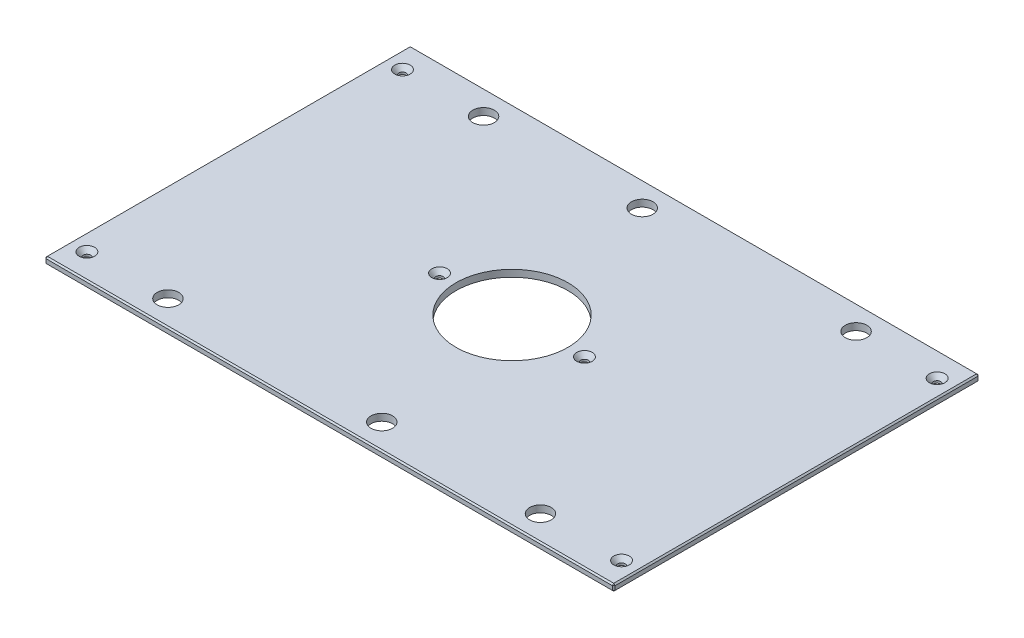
from build123d import *

# Parameters (mm, degrees)
SKETCH1_W                                     = 523.875
SKETCH1_H                                     = 336.55
BOSS_EXTRUDE1_DEPTH                           = 6.35
SKETCH13_R                                    = 51.562
CUT_EXTRUDE6_DEPTH                            = 312.396936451
F_25_32_0_78125_DIAMETER_HOLE1_D              = 19.84375
CHAMFER2_SIZE                                 = 1.27
CSK_FOR_1_4_FLAT_HEAD_MACHINE_SCREW1_AT_COUNT = 2
CSK_FOR_1_4_FLAT_HEAD_MACHINE_SCREW1_AT_PITCH = 290.50996
CSK_FOR_1_4_FLAT_HEAD_MACHINE_SCREW1_2_COUNT  = 2
CSK_FOR_1_4_FLAT_HEAD_MACHINE_SCREW1_2_PITCH  = 571.474454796
CSK_FOR_1_4_FLAT_HEAD_MACHINE_SCREW1_3_COUNT  = 2
CSK_FOR_1_4_FLAT_HEAD_MACHINE_SCREW1_3_PITCH  = 344.824235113
CSK_FOR_1_4_FLAT_HEAD_MACHINE_SCREW1_4_COUNT  = 2
CSK_FOR_1_4_FLAT_HEAD_MACHINE_SCREW1_4_PITCH  = 230.822192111
CSK_FOR_1_4_FLAT_HEAD_MACHINE_SCREW1_5_COUNT  = 2
CSK_FOR_1_4_FLAT_HEAD_MACHINE_SCREW1_5_PITCH  = 492.125
CSK_FOR_1_4_FLAT_HEAD_MACHINE_SCREW1_6_COUNT  = 2
CSK_FOR_1_4_FLAT_HEAD_MACHINE_SCREW1_6_PITCH  = 417.5125
CSK_FOR_1_4_FLAT_HEAD_MACHINE_SCREW1_7_COUNT  = 2
CSK_FOR_1_4_FLAT_HEAD_MACHINE_SCREW1_7_PITCH  = 508.638107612


with BuildPart() as part:
    # Sketch1 → Boss-Extrude1 (new body)
    with BuildSketch(Plane(origin=(0, 0, 0), x_dir=(1, 0, 0), z_dir=(0, 1, 0))):
        Rectangle(SKETCH1_W, SKETCH1_H)
    extrude(amount=BOSS_EXTRUDE1_DEPTH)

    # Sketch13 → Cut-Extrude6 (cut, through all)
    with BuildSketch(Plane(origin=(0, 6.35, 0), x_dir=(1, 0, 0), z_dir=(0, 1, 0))):
        with Locations(Location((0, 0, 0), (0, 0, 270))):
            Circle(SKETCH13_R)
    extrude(amount=-CUT_EXTRUDE6_DEPTH, mode=Mode.SUBTRACT)

    # 25_32 _0.78125_ Diameter Hole1 (through all)
    with Locations(Plane(origin=(0, 6.35, 0), x_dir=(1, 0, 0), z_dir=(0, 1, 0))):
        with Locations((171.45, 145.25498), (-171.45, 145.25498), (171.45, -145.25498), (-171.45, -145.25498), (-25.4, 145.25498), (25.4, -145.25498)):
            Hole(F_25_32_0_78125_DIAMETER_HOLE1_D / 2)

    # Chamfer2
    chamfer2_edges = [part.edges().sort_by_distance(p)[0] for p in [
        (261.9375, 6.35, 0),
        (0, 6.35, -168.275),
        (-261.9375, 6.35, 0),
        (0, 0, -168.275),
        (261.9375, 0, 0),
        (0, 0, 168.275),
        (-261.9375, 0, 0),
        (0, 6.35, 168.275),
        (-261.9375, 3.175, -168.275),
        (261.9375, 3.175, -168.275),
        (261.9375, 3.175, 168.275),
        (-261.9375, 3.175, 168.275),
    ]]
    chamfer(chamfer2_edges, length=CHAMFER2_SIZE)

    # Sketch24 → CSK for 1_4 Flat Head Machine Screw1 (revolve, cut)
    with BuildSketch(Plane(origin=(246.0625, 6.35, -145.25498), x_dir=(0, 0, 1), z_dir=(1, 0, 0))):
        Polygon((0, 0), (0, 6.35), (3.3782, 6.35), (3.3782, 4.324464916), (7.1374, 0), align=None)
    csk_for_1_4_flat_head_machine_screw1 = revolve(axis=Axis((246.0625, 12.7, -145.25498), (0, -1, 0)), mode=Mode.SUBTRACT)

    # CSK for 1_4 Flat Head Machine Screw1 at: CSK for 1_4 Flat Head Machine Screw1 ×2
    with Locations(*[(0, 0, i * CSK_FOR_1_4_FLAT_HEAD_MACHINE_SCREW1_AT_PITCH) for i in range(1, CSK_FOR_1_4_FLAT_HEAD_MACHINE_SCREW1_AT_COUNT)]):
        add(csk_for_1_4_flat_head_machine_screw1, mode=Mode.SUBTRACT)

    # CSK for 1_4 Flat Head Machine Screw1 2: CSK for 1_4 Flat Head Machine Screw1 ×2
    with Locations(*[Vector(-0.861149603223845, 0, 0.5083516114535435) * (i * CSK_FOR_1_4_FLAT_HEAD_MACHINE_SCREW1_2_PITCH) for i in range(1, CSK_FOR_1_4_FLAT_HEAD_MACHINE_SCREW1_2_COUNT)]):
        add(csk_for_1_4_flat_head_machine_screw1, mode=Mode.SUBTRACT)

    # CSK for 1_4 Flat Head Machine Screw1 3: CSK for 1_4 Flat Head Machine Screw1 ×2
    with Locations(*[Vector(-0.9069475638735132, 0, 0.4212435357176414) * (i * CSK_FOR_1_4_FLAT_HEAD_MACHINE_SCREW1_3_PITCH) for i in range(1, CSK_FOR_1_4_FLAT_HEAD_MACHINE_SCREW1_3_COUNT)]):
        add(csk_for_1_4_flat_head_machine_screw1, mode=Mode.SUBTRACT)

    # CSK for 1_4 Flat Head Machine Screw1 4: CSK for 1_4 Flat Head Machine Screw1 ×2
    with Locations(*[Vector(-0.7771674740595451, 0, 0.6292938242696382) * (i * CSK_FOR_1_4_FLAT_HEAD_MACHINE_SCREW1_4_PITCH) for i in range(1, CSK_FOR_1_4_FLAT_HEAD_MACHINE_SCREW1_4_COUNT)]):
        add(csk_for_1_4_flat_head_machine_screw1, mode=Mode.SUBTRACT)

    # CSK for 1_4 Flat Head Machine Screw1 5: CSK for 1_4 Flat Head Machine Screw1 ×2
    with Locations(*[(-i * CSK_FOR_1_4_FLAT_HEAD_MACHINE_SCREW1_5_PITCH, 0, 0) for i in range(1, CSK_FOR_1_4_FLAT_HEAD_MACHINE_SCREW1_5_COUNT)]):
        add(csk_for_1_4_flat_head_machine_screw1, mode=Mode.SUBTRACT)

    # CSK for 1_4 Flat Head Machine Screw1 6: CSK for 1_4 Flat Head Machine Screw1 ×2
    with Locations(*[(-i * CSK_FOR_1_4_FLAT_HEAD_MACHINE_SCREW1_6_PITCH, 0, 0) for i in range(1, CSK_FOR_1_4_FLAT_HEAD_MACHINE_SCREW1_6_COUNT)]):
        add(csk_for_1_4_flat_head_machine_screw1, mode=Mode.SUBTRACT)

    # CSK for 1_4 Flat Head Machine Screw1 7: CSK for 1_4 Flat Head Machine Screw1 ×2
    with Locations(*[Vector(-0.8208439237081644, 0, 0.5711525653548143) * (i * CSK_FOR_1_4_FLAT_HEAD_MACHINE_SCREW1_7_PITCH) for i in range(1, CSK_FOR_1_4_FLAT_HEAD_MACHINE_SCREW1_7_COUNT)]):
        add(csk_for_1_4_flat_head_machine_screw1, mode=Mode.SUBTRACT)


solid = part.part
